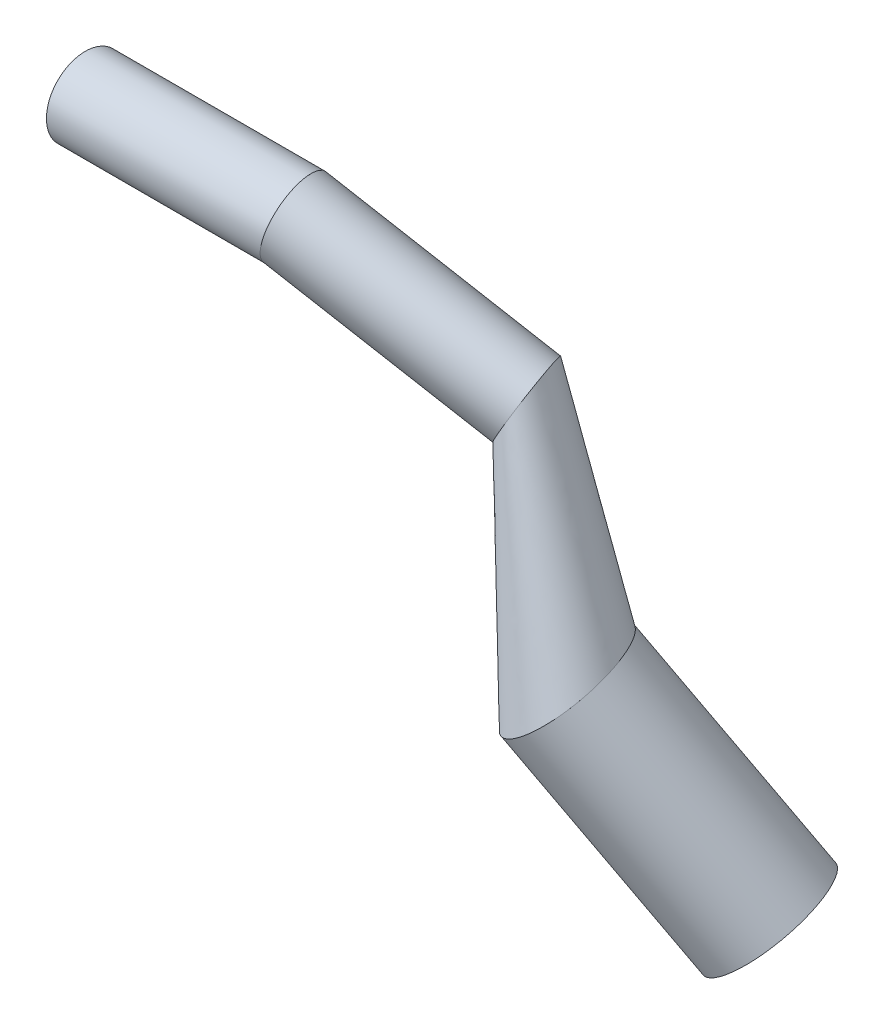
ISO-10303-21;
HEADER;
FILE_DESCRIPTION(('STEP AP214'),'2;1');
FILE_NAME('part.step','',(''),(''),'','','');
FILE_SCHEMA(('AUTOMOTIVE_DESIGN { 1 0 10303 214 1 1 1 1 }'));
ENDSEC;
DATA;
#1=APPLICATION_CONTEXT('core data for automotive mechanical design processes');
#2=APPLICATION_PROTOCOL_DEFINITION('international standard','automotive_design',2000,#1);
#3=PRODUCT_CONTEXT('',#1,'mechanical');
#4=PRODUCT('Part','Part','',(#3));
#5=PRODUCT_RELATED_PRODUCT_CATEGORY('part','',(#4));
#6=PRODUCT_DEFINITION_FORMATION('','',#4);
#7=PRODUCT_DEFINITION_CONTEXT('part definition',#1,'design');
#8=PRODUCT_DEFINITION('design','',#6,#7);
#9=PRODUCT_DEFINITION_SHAPE('','',#8);
#10=(LENGTH_UNIT() NAMED_UNIT(*) SI_UNIT(.MILLI.,.METRE.));
#11=(NAMED_UNIT(*) PLANE_ANGLE_UNIT() SI_UNIT($,.RADIAN.));
#12=(NAMED_UNIT(*) SI_UNIT($,.STERADIAN.) SOLID_ANGLE_UNIT());
#13=UNCERTAINTY_MEASURE_WITH_UNIT(LENGTH_MEASURE(1.E-05),#10,'distance_accuracy_value','');
#14=(GEOMETRIC_REPRESENTATION_CONTEXT(3) GLOBAL_UNCERTAINTY_ASSIGNED_CONTEXT((#13)) GLOBAL_UNIT_ASSIGNED_CONTEXT((#10,
#11,#12)) REPRESENTATION_CONTEXT('',''));
#15=CARTESIAN_POINT('',(0.,0.,0.));
#16=DIRECTION('',(0.,0.,1.));
#17=DIRECTION('',(1.,0.,0.));
#18=AXIS2_PLACEMENT_3D('',#15,#16,#17);
#19=CARTESIAN_POINT('',(110.458547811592,-18.1572783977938,-15.9377275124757));
#20=DIRECTION('',(-0.833138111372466,0.478048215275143,0.278120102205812));
#21=DIRECTION('',(-0.497683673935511,-0.867358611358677,0.));
#22=AXIS2_PLACEMENT_3D('',#19,#20,#21);
#23=PLANE('',#22);
#24=CARTESIAN_POINT('',(99.8578855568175,-36.6320168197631,-15.9377275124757));
#25=CARTESIAN_POINT('',(99.7508398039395,-36.5705947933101,-16.3639699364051));
#26=CARTESIAN_POINT('',(99.6507352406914,-36.4814227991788,-16.8171174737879));
#27=CARTESIAN_POINT('',(99.476785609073,-36.2277559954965,-17.7742184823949));
#28=CARTESIAN_POINT('',(99.4029375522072,-36.0631861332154,-18.2783099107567));
#29=CARTESIAN_POINT('',(99.2981651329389,-35.636345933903,-19.3258432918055));
#30=CARTESIAN_POINT('',(99.2672916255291,-35.3739056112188,-19.8694250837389));
#31=CARTESIAN_POINT('',(99.2688874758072,-34.729963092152,-20.9714885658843));
#32=CARTESIAN_POINT('',(99.3014982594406,-34.3481807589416,-21.5300281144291));
#33=CARTESIAN_POINT('',(99.451487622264,-33.451950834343,-22.6212087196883));
#34=CARTESIAN_POINT('',(99.5691073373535,-32.9371735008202,-23.1536942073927));
#35=CARTESIAN_POINT('',(99.9057838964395,-31.7786052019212,-24.1365553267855));
#36=CARTESIAN_POINT('',(100.125109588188,-31.1346158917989,-24.5864665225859));
#37=CARTESIAN_POINT('',(100.669074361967,-29.7472704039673,-25.3416088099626));
#38=CARTESIAN_POINT('',(100.993842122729,-29.0040808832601,-25.6461679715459));
#39=CARTESIAN_POINT('',(101.73309966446,-27.4753005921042,-26.0593961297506));
#40=CARTESIAN_POINT('',(102.147424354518,-26.6902997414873,-26.1675456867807));
#41=CARTESIAN_POINT('',(103.030812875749,-25.1507382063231,-26.1675456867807));
#42=CARTESIAN_POINT('',(103.499458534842,-24.3969063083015,-26.0593961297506));
#43=CARTESIAN_POINT('',(104.446270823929,-22.9872193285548,-25.6461679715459));
#44=CARTESIAN_POINT('',(104.924011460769,-22.3318044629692,-25.3416088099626));
#45=CARTESIAN_POINT('',(105.847266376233,-21.162092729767,-24.5864665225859));
#46=CARTESIAN_POINT('',(106.292571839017,-20.6477688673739,-24.1365553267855));
#47=CARTESIAN_POINT('',(107.122916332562,-19.7724634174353,-23.1536942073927));
#48=CARTESIAN_POINT('',(107.507990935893,-19.4111496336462,-22.6212087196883));
#49=CARTESIAN_POINT('',(108.206054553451,-18.8294004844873,-21.5300281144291));
#50=CARTESIAN_POINT('',(108.519206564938,-18.6085905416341,-20.9714885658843));
#51=CARTESIAN_POINT('',(109.074342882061,-18.2822652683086,-19.8694250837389));
#52=CARTESIAN_POINT('',(109.316497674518,-18.1764864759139,-19.3258432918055));
#53=CARTESIAN_POINT('',(109.737876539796,-18.0515478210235,-18.2783099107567));
#54=CARTESIAN_POINT('',(109.917221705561,-18.0322582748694,-17.7742184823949));
#55=CARTESIAN_POINT('',(110.224001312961,-18.0544301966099,-16.8171174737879));
#56=CARTESIAN_POINT('',(110.351502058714,-18.0958563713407,-16.3639699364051));
#57=CARTESIAN_POINT('',(110.56559356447,-18.2187004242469,-15.5114850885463));
#58=CARTESIAN_POINT('',(110.665698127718,-18.3078724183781,-15.0583375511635));
#59=CARTESIAN_POINT('',(110.839647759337,-18.5615392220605,-14.1012365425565));
#60=CARTESIAN_POINT('',(110.913495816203,-18.7261090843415,-13.5971451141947));
#61=CARTESIAN_POINT('',(111.018268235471,-19.1529492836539,-12.5496117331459));
#62=CARTESIAN_POINT('',(111.049141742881,-19.4153896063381,-12.0060299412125));
#63=CARTESIAN_POINT('',(111.047545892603,-20.0593321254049,-10.9039664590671));
#64=CARTESIAN_POINT('',(111.014935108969,-20.4411144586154,-10.3454269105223));
#65=CARTESIAN_POINT('',(110.864945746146,-21.337344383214,-9.2542463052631));
#66=CARTESIAN_POINT('',(110.747326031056,-21.8521217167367,-8.72176081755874));
#67=CARTESIAN_POINT('',(110.41064947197,-23.0106900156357,-7.73889969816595));
#68=CARTESIAN_POINT('',(110.191323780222,-23.654679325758,-7.28898850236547));
#69=CARTESIAN_POINT('',(109.647359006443,-25.0420248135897,-6.53384621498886));
#70=CARTESIAN_POINT('',(109.322591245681,-25.7852143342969,-6.22928705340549));
#71=CARTESIAN_POINT('',(108.58333370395,-27.3139946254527,-5.81605889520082));
#72=CARTESIAN_POINT('',(108.169009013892,-28.0989954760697,-5.70790933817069));
#73=CARTESIAN_POINT('',(107.285620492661,-29.6385570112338,-5.70790933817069));
#74=CARTESIAN_POINT('',(106.816974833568,-30.3923889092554,-5.81605889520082));
#75=CARTESIAN_POINT('',(105.870162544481,-31.8020758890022,-6.22928705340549));
#76=CARTESIAN_POINT('',(105.392421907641,-32.4574907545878,-6.53384621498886));
#77=CARTESIAN_POINT('',(104.469166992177,-33.6272024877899,-7.28898850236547));
#78=CARTESIAN_POINT('',(104.023861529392,-34.1415263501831,-7.73889969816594));
#79=CARTESIAN_POINT('',(103.193517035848,-35.0168318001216,-8.72176081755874));
#80=CARTESIAN_POINT('',(102.808442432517,-35.3781455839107,-9.25424630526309));
#81=CARTESIAN_POINT('',(102.110378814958,-35.9598947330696,-10.3454269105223));
#82=CARTESIAN_POINT('',(101.797226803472,-36.1807046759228,-10.9039664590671));
#83=CARTESIAN_POINT('',(101.242090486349,-36.5070299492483,-12.0060299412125));
#84=CARTESIAN_POINT('',(100.999935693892,-36.6128087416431,-12.5496117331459));
#85=CARTESIAN_POINT('',(100.578556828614,-36.7377473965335,-13.5971451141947));
#86=CARTESIAN_POINT('',(100.399211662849,-36.7570369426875,-14.1012365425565));
#87=CARTESIAN_POINT('',(100.092432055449,-36.734865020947,-15.0583375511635));
#88=CARTESIAN_POINT('',(99.9649313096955,-36.6934388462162,-15.5114850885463));
#89=CARTESIAN_POINT('',(99.8578855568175,-36.6320168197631,-15.9377275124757));
#90=B_SPLINE_CURVE_WITH_KNOTS('',3,(#24,#25,#26,#27,#28,#29,#30,#31,#32,#33,#34,#35,#36,#37,#38,
#39,#40,#41,#42,#43,#44,#45,#46,#47,#48,#49,#50,#51,#52,#53,#54,#55,#56,#57,#58,#59,#60,#61,#62,
#63,#64,#65,#66,#67,#68,#69,#70,#71,#72,#73,#74,#75,#76,#77,#78,#79,#80,#81,#82,#83,#84,#85,#86,
#87,#88,#89),.UNSPECIFIED.,.T.,.F.,(4,2,2,2,2,2,2,2,2,2,2,2,2,2,2,2,2,2,2,2,2,2,2,2,2,2,2,2,2,2,
2,2,4),(0.,0.0312499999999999,0.0624999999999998,0.0937499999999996,0.125,0.156249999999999,
0.187499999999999,0.218749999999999,0.249999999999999,0.281249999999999,0.312499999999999,
0.343749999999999,0.374999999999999,0.406249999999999,0.437499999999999,0.468749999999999,
0.499999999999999,0.531249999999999,0.562499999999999,0.593749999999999,0.624999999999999,
0.656249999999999,0.687499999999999,0.718749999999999,0.749999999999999,0.781249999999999,
0.812499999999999,0.843749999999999,0.874999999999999,0.90625,0.9375,0.96875,1.),.UNSPECIFIED.);
#91=CARTESIAN_POINT('',(99.8578855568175,-36.6320168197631,-15.9377275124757));
#92=VERTEX_POINT('',#91);
#93=EDGE_CURVE('E65',#92,#92,#90,.T.);
#94=ORIENTED_EDGE('',*,*,#93,.F.);
#95=EDGE_LOOP('',(#94));
#96=FACE_BOUND('',#95,.T.);
#97=ADVANCED_FACE('F56',(#96),#23,.T.);
#98=CARTESIAN_POINT('',(135.931990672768,-72.0496322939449,-9.68406513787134));
#99=DIRECTION('',(-0.580553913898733,0.757744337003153,0.297960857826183));
#100=DIRECTION('',(-0.793800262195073,-0.608178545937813,0.));
#101=AXIS2_PLACEMENT_3D('',#98,#99,#100);
#102=PLANE('',#101);
#103=CARTESIAN_POINT('',(109.180921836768,-92.5452492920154,-9.6840651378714));
#104=CARTESIAN_POINT('',(109.053694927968,-92.3791915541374,-10.354258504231));
#105=CARTESIAN_POINT('',(108.953004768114,-92.176167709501,-11.0667555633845));
#106=CARTESIAN_POINT('',(108.834924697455,-91.6748867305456,-12.5716333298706));
#107=CARTESIAN_POINT('',(108.817573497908,-91.3765146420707,-13.3642309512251));
#108=CARTESIAN_POINT('',(108.904383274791,-90.6623432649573,-15.0112981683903));
#109=CARTESIAN_POINT('',(109.008719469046,-90.2463232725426,-15.8659876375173));
#110=CARTESIAN_POINT('',(109.382234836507,-89.2787748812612,-17.5987941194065));
#111=CARTESIAN_POINT('',(109.651790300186,-88.7269224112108,-18.4770021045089));
#112=CARTESIAN_POINT('',(110.396132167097,-87.4819899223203,-20.1926971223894));
#113=CARTESIAN_POINT('',(110.871474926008,-86.7885798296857,-21.0299395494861));
#114=CARTESIAN_POINT('',(112.050610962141,-85.2774961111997,-22.5753206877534));
#115=CARTESIAN_POINT('',(112.754926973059,-84.4597091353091,-23.2827291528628));
#116=CARTESIAN_POINT('',(114.380813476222,-82.7471350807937,-24.4700613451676));
#117=CARTESIAN_POINT('',(115.302483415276,-81.8526872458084,-24.948928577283));
#118=CARTESIAN_POINT('',(117.306563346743,-80.061752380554,-25.5986592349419));
#119=CARTESIAN_POINT('',(118.38838257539,-79.1660391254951,-25.7687059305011));
#120=CARTESIAN_POINT('',(120.617638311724,-77.4580710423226,-25.7687059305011));
#121=CARTESIAN_POINT('',(121.764019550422,-76.6466247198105,-25.5986592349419));
#122=CARTESIAN_POINT('',(124.014784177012,-75.1776649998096,-24.948928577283));
#123=CARTESIAN_POINT('',(125.118266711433,-74.5205206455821,-24.4700613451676));
#124=CARTESIAN_POINT('',(127.194950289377,-73.3963311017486,-23.2827291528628));
#125=CARTESIAN_POINT('',(128.167849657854,-72.9291016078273,-22.5753206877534));
#126=CARTESIAN_POINT('',(129.933724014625,-72.183834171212,-21.0299395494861));
#127=CARTESIAN_POINT('',(130.726944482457,-71.9053210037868,-20.1926971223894));
#128=CARTESIAN_POINT('',(132.122688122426,-71.5106041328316,-18.4770021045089));
#129=CARTESIAN_POINT('',(132.725674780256,-71.3939491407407,-17.5987941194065));
#130=CARTESIAN_POINT('',(133.757088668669,-71.2850959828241,-15.8659876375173));
#131=CARTESIAN_POINT('',(134.1859267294,-71.2926188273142,-15.0112981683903));
#132=CARTESIAN_POINT('',(134.898082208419,-71.3946544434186,-13.3642309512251));
#133=CARTESIAN_POINT('',(135.181658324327,-71.4890554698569,-12.5716333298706));
#134=CARTESIAN_POINT('',(135.634938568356,-71.7335192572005,-11.0667555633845));
#135=CARTESIAN_POINT('',(135.804763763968,-71.883574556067,-10.354258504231));
#136=CARTESIAN_POINT('',(136.059217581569,-72.2156900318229,-9.01387177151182));
#137=CARTESIAN_POINT('',(136.159907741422,-72.4187138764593,-8.30137471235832));
#138=CARTESIAN_POINT('',(136.277987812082,-72.9199948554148,-6.79649694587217));
#139=CARTESIAN_POINT('',(136.295339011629,-73.2183669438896,-6.00389932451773));
#140=CARTESIAN_POINT('',(136.208529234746,-73.9325383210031,-4.35683210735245));
#141=CARTESIAN_POINT('',(136.10419304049,-74.3485583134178,-3.50214263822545));
#142=CARTESIAN_POINT('',(135.730677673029,-75.3161067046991,-1.76933615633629));
#143=CARTESIAN_POINT('',(135.46112220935,-75.8679591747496,-0.891128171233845));
#144=CARTESIAN_POINT('',(134.71678034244,-77.11289166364,0.824566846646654));
#145=CARTESIAN_POINT('',(134.241437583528,-77.8063017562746,1.66180927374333));
#146=CARTESIAN_POINT('',(133.062301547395,-79.3173854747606,3.20719041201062));
#147=CARTESIAN_POINT('',(132.357985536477,-80.1351724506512,3.91459887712));
#148=CARTESIAN_POINT('',(130.732099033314,-81.8477465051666,5.10193106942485));
#149=CARTESIAN_POINT('',(129.810429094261,-82.7421943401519,5.58079830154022));
#150=CARTESIAN_POINT('',(127.806349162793,-84.5331292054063,6.2305289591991));
#151=CARTESIAN_POINT('',(126.724529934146,-85.4288424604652,6.40057565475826));
#152=CARTESIAN_POINT('',(124.495274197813,-87.1368105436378,6.40057565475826));
#153=CARTESIAN_POINT('',(123.348892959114,-87.9482568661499,6.2305289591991));
#154=CARTESIAN_POINT('',(121.098128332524,-89.4172165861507,5.58079830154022));
#155=CARTESIAN_POINT('',(119.994645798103,-90.0743609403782,5.10193106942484));
#156=CARTESIAN_POINT('',(117.917962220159,-91.1985504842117,3.91459887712));
#157=CARTESIAN_POINT('',(116.945062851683,-91.6657799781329,3.20719041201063));
#158=CARTESIAN_POINT('',(115.179188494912,-92.4110474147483,1.66180927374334));
#159=CARTESIAN_POINT('',(114.38596802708,-92.6895605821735,0.824566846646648));
#160=CARTESIAN_POINT('',(112.99022438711,-93.0842774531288,-0.89112817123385));
#161=CARTESIAN_POINT('',(112.387237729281,-93.2009324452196,-1.76933615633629));
#162=CARTESIAN_POINT('',(111.355823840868,-93.3097856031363,-3.50214263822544));
#163=CARTESIAN_POINT('',(110.926985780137,-93.3022627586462,-4.35683210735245));
#164=CARTESIAN_POINT('',(110.214830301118,-93.2002271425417,-6.00389932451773));
#165=CARTESIAN_POINT('',(109.931254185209,-93.1058261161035,-6.79649694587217));
#166=CARTESIAN_POINT('',(109.47797394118,-92.8613623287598,-8.30137471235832));
#167=CARTESIAN_POINT('',(109.308148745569,-92.7113070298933,-9.01387177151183));
#168=CARTESIAN_POINT('',(109.180921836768,-92.5452492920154,-9.6840651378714));
#169=B_SPLINE_CURVE_WITH_KNOTS('',3,(#103,#104,#105,#106,#107,#108,#109,#110,#111,#112,#113,
#114,#115,#116,#117,#118,#119,#120,#121,#122,#123,#124,#125,#126,#127,#128,#129,#130,#131,#132,
#133,#134,#135,#136,#137,#138,#139,#140,#141,#142,#143,#144,#145,#146,#147,#148,#149,#150,#151,
#152,#153,#154,#155,#156,#157,#158,#159,#160,#161,#162,#163,#164,#165,#166,#167,#168),
.UNSPECIFIED.,.T.,.F.,(4,2,2,2,2,2,2,2,2,2,2,2,2,2,2,2,2,2,2,2,2,2,2,2,2,2,2,2,2,2,2,2,4),(0.,
0.0312499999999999,0.0624999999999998,0.0937499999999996,0.125,0.156249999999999,
0.187499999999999,0.218749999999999,0.249999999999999,0.281249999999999,0.312499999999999,
0.343749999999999,0.374999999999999,0.406249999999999,0.437499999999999,0.468749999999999,
0.499999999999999,0.531249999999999,0.562499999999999,0.593749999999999,0.624999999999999,
0.656249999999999,0.687499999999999,0.718749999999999,0.749999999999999,0.781249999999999,
0.812499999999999,0.843749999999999,0.874999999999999,0.90625,0.9375,0.96875,1.),.UNSPECIFIED.);
#170=CARTESIAN_POINT('',(109.180921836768,-92.5452492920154,-9.6840651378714));
#171=VERTEX_POINT('',#170);
#172=EDGE_CURVE('E12',#171,#171,#169,.F.);
#173=ORIENTED_EDGE('',*,*,#172,.F.);
#174=EDGE_LOOP('',(#173));
#175=FACE_BOUND('',#174,.T.);
#176=ADVANCED_FACE('F58',(#175),#102,.F.);
#177=CARTESIAN_POINT('',(99.8578855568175,-36.6320168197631,-15.9377275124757));
#178=CARTESIAN_POINT('',(109.180921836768,-92.5452492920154,-9.6840651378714));
#179=CARTESIAN_POINT('',(99.7508398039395,-36.5705947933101,-16.3639699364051));
#180=CARTESIAN_POINT('',(109.053694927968,-92.3791915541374,-10.354258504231));
#181=CARTESIAN_POINT('',(99.6507352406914,-36.4814227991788,-16.8171174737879));
#182=CARTESIAN_POINT('',(108.953004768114,-92.176167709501,-11.0667555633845));
#183=CARTESIAN_POINT('',(99.476785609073,-36.2277559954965,-17.7742184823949));
#184=CARTESIAN_POINT('',(108.834924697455,-91.6748867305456,-12.5716333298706));
#185=CARTESIAN_POINT('',(99.4029375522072,-36.0631861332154,-18.2783099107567));
#186=CARTESIAN_POINT('',(108.817573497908,-91.3765146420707,-13.3642309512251));
#187=CARTESIAN_POINT('',(99.2981651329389,-35.636345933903,-19.3258432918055));
#188=CARTESIAN_POINT('',(108.904383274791,-90.6623432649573,-15.0112981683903));
#189=CARTESIAN_POINT('',(99.2672916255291,-35.3739056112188,-19.8694250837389));
#190=CARTESIAN_POINT('',(109.008719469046,-90.2463232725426,-15.8659876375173));
#191=CARTESIAN_POINT('',(99.2688874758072,-34.729963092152,-20.9714885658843));
#192=CARTESIAN_POINT('',(109.382234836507,-89.2787748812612,-17.5987941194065));
#193=CARTESIAN_POINT('',(99.3014982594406,-34.3481807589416,-21.5300281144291));
#194=CARTESIAN_POINT('',(109.651790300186,-88.7269224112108,-18.4770021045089));
#195=CARTESIAN_POINT('',(99.451487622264,-33.451950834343,-22.6212087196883));
#196=CARTESIAN_POINT('',(110.396132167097,-87.4819899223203,-20.1926971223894));
#197=CARTESIAN_POINT('',(99.5691073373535,-32.9371735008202,-23.1536942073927));
#198=CARTESIAN_POINT('',(110.871474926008,-86.7885798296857,-21.0299395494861));
#199=CARTESIAN_POINT('',(99.9057838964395,-31.7786052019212,-24.1365553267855));
#200=CARTESIAN_POINT('',(112.050610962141,-85.2774961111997,-22.5753206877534));
#201=CARTESIAN_POINT('',(100.125109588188,-31.1346158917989,-24.5864665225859));
#202=CARTESIAN_POINT('',(112.754926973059,-84.4597091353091,-23.2827291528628));
#203=CARTESIAN_POINT('',(100.669074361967,-29.7472704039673,-25.3416088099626));
#204=CARTESIAN_POINT('',(114.380813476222,-82.7471350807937,-24.4700613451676));
#205=CARTESIAN_POINT('',(100.993842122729,-29.0040808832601,-25.6461679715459));
#206=CARTESIAN_POINT('',(115.302483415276,-81.8526872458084,-24.948928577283));
#207=CARTESIAN_POINT('',(101.73309966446,-27.4753005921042,-26.0593961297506));
#208=CARTESIAN_POINT('',(117.306563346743,-80.061752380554,-25.5986592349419));
#209=CARTESIAN_POINT('',(102.147424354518,-26.6902997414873,-26.1675456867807));
#210=CARTESIAN_POINT('',(118.38838257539,-79.1660391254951,-25.7687059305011));
#211=CARTESIAN_POINT('',(103.030812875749,-25.1507382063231,-26.1675456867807));
#212=CARTESIAN_POINT('',(120.617638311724,-77.4580710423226,-25.7687059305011));
#213=CARTESIAN_POINT('',(103.499458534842,-24.3969063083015,-26.0593961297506));
#214=CARTESIAN_POINT('',(121.764019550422,-76.6466247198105,-25.5986592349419));
#215=CARTESIAN_POINT('',(104.446270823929,-22.9872193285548,-25.6461679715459));
#216=CARTESIAN_POINT('',(124.014784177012,-75.1776649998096,-24.948928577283));
#217=CARTESIAN_POINT('',(104.924011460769,-22.3318044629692,-25.3416088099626));
#218=CARTESIAN_POINT('',(125.118266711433,-74.5205206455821,-24.4700613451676));
#219=CARTESIAN_POINT('',(105.847266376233,-21.162092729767,-24.5864665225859));
#220=CARTESIAN_POINT('',(127.194950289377,-73.3963311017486,-23.2827291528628));
#221=CARTESIAN_POINT('',(106.292571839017,-20.6477688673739,-24.1365553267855));
#222=CARTESIAN_POINT('',(128.167849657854,-72.9291016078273,-22.5753206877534));
#223=CARTESIAN_POINT('',(107.122916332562,-19.7724634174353,-23.1536942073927));
#224=CARTESIAN_POINT('',(129.933724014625,-72.183834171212,-21.0299395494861));
#225=CARTESIAN_POINT('',(107.507990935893,-19.4111496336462,-22.6212087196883));
#226=CARTESIAN_POINT('',(130.726944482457,-71.9053210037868,-20.1926971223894));
#227=CARTESIAN_POINT('',(108.206054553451,-18.8294004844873,-21.5300281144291));
#228=CARTESIAN_POINT('',(132.122688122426,-71.5106041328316,-18.4770021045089));
#229=CARTESIAN_POINT('',(108.519206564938,-18.6085905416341,-20.9714885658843));
#230=CARTESIAN_POINT('',(132.725674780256,-71.3939491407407,-17.5987941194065));
#231=CARTESIAN_POINT('',(109.074342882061,-18.2822652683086,-19.8694250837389));
#232=CARTESIAN_POINT('',(133.757088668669,-71.2850959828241,-15.8659876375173));
#233=CARTESIAN_POINT('',(109.316497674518,-18.1764864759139,-19.3258432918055));
#234=CARTESIAN_POINT('',(134.1859267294,-71.2926188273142,-15.0112981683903));
#235=CARTESIAN_POINT('',(109.737876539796,-18.0515478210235,-18.2783099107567));
#236=CARTESIAN_POINT('',(134.898082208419,-71.3946544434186,-13.3642309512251));
#237=CARTESIAN_POINT('',(109.917221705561,-18.0322582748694,-17.7742184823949));
#238=CARTESIAN_POINT('',(135.181658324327,-71.4890554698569,-12.5716333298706));
#239=CARTESIAN_POINT('',(110.224001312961,-18.0544301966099,-16.8171174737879));
#240=CARTESIAN_POINT('',(135.634938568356,-71.7335192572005,-11.0667555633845));
#241=CARTESIAN_POINT('',(110.351502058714,-18.0958563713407,-16.3639699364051));
#242=CARTESIAN_POINT('',(135.804763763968,-71.883574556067,-10.354258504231));
#243=CARTESIAN_POINT('',(110.56559356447,-18.2187004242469,-15.5114850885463));
#244=CARTESIAN_POINT('',(136.059217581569,-72.2156900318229,-9.01387177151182));
#245=CARTESIAN_POINT('',(110.665698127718,-18.3078724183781,-15.0583375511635));
#246=CARTESIAN_POINT('',(136.159907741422,-72.4187138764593,-8.30137471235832));
#247=CARTESIAN_POINT('',(110.839647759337,-18.5615392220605,-14.1012365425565));
#248=CARTESIAN_POINT('',(136.277987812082,-72.9199948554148,-6.79649694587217));
#249=CARTESIAN_POINT('',(110.913495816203,-18.7261090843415,-13.5971451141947));
#250=CARTESIAN_POINT('',(136.295339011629,-73.2183669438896,-6.00389932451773));
#251=CARTESIAN_POINT('',(111.018268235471,-19.1529492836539,-12.5496117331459));
#252=CARTESIAN_POINT('',(136.208529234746,-73.9325383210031,-4.35683210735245));
#253=CARTESIAN_POINT('',(111.049141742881,-19.4153896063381,-12.0060299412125));
#254=CARTESIAN_POINT('',(136.10419304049,-74.3485583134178,-3.50214263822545));
#255=CARTESIAN_POINT('',(111.047545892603,-20.0593321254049,-10.9039664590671));
#256=CARTESIAN_POINT('',(135.730677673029,-75.3161067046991,-1.76933615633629));
#257=CARTESIAN_POINT('',(111.014935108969,-20.4411144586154,-10.3454269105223));
#258=CARTESIAN_POINT('',(135.46112220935,-75.8679591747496,-0.891128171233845));
#259=CARTESIAN_POINT('',(110.864945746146,-21.337344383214,-9.2542463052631));
#260=CARTESIAN_POINT('',(134.71678034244,-77.11289166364,0.824566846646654));
#261=CARTESIAN_POINT('',(110.747326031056,-21.8521217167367,-8.72176081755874));
#262=CARTESIAN_POINT('',(134.241437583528,-77.8063017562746,1.66180927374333));
#263=CARTESIAN_POINT('',(110.41064947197,-23.0106900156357,-7.73889969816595));
#264=CARTESIAN_POINT('',(133.062301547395,-79.3173854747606,3.20719041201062));
#265=CARTESIAN_POINT('',(110.191323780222,-23.654679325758,-7.28898850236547));
#266=CARTESIAN_POINT('',(132.357985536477,-80.1351724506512,3.91459887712));
#267=CARTESIAN_POINT('',(109.647359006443,-25.0420248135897,-6.53384621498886));
#268=CARTESIAN_POINT('',(130.732099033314,-81.8477465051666,5.10193106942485));
#269=CARTESIAN_POINT('',(109.322591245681,-25.7852143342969,-6.22928705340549));
#270=CARTESIAN_POINT('',(129.810429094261,-82.7421943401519,5.58079830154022));
#271=CARTESIAN_POINT('',(108.58333370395,-27.3139946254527,-5.81605889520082));
#272=CARTESIAN_POINT('',(127.806349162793,-84.5331292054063,6.2305289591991));
#273=CARTESIAN_POINT('',(108.169009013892,-28.0989954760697,-5.70790933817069));
#274=CARTESIAN_POINT('',(126.724529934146,-85.4288424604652,6.40057565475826));
#275=CARTESIAN_POINT('',(107.285620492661,-29.6385570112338,-5.70790933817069));
#276=CARTESIAN_POINT('',(124.495274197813,-87.1368105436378,6.40057565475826));
#277=CARTESIAN_POINT('',(106.816974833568,-30.3923889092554,-5.81605889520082));
#278=CARTESIAN_POINT('',(123.348892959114,-87.9482568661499,6.2305289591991));
#279=CARTESIAN_POINT('',(105.870162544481,-31.8020758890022,-6.22928705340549));
#280=CARTESIAN_POINT('',(121.098128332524,-89.4172165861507,5.58079830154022));
#281=CARTESIAN_POINT('',(105.392421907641,-32.4574907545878,-6.53384621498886));
#282=CARTESIAN_POINT('',(119.994645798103,-90.0743609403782,5.10193106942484));
#283=CARTESIAN_POINT('',(104.469166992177,-33.6272024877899,-7.28898850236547));
#284=CARTESIAN_POINT('',(117.917962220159,-91.1985504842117,3.91459887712));
#285=CARTESIAN_POINT('',(104.023861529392,-34.1415263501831,-7.73889969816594));
#286=CARTESIAN_POINT('',(116.945062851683,-91.6657799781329,3.20719041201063));
#287=CARTESIAN_POINT('',(103.193517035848,-35.0168318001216,-8.72176081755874));
#288=CARTESIAN_POINT('',(115.179188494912,-92.4110474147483,1.66180927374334));
#289=CARTESIAN_POINT('',(102.808442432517,-35.3781455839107,-9.25424630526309));
#290=CARTESIAN_POINT('',(114.38596802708,-92.6895605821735,0.824566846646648));
#291=CARTESIAN_POINT('',(102.110378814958,-35.9598947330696,-10.3454269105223));
#292=CARTESIAN_POINT('',(112.99022438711,-93.0842774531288,-0.89112817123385));
#293=CARTESIAN_POINT('',(101.797226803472,-36.1807046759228,-10.9039664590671));
#294=CARTESIAN_POINT('',(112.387237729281,-93.2009324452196,-1.76933615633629));
#295=CARTESIAN_POINT('',(101.242090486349,-36.5070299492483,-12.0060299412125));
#296=CARTESIAN_POINT('',(111.355823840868,-93.3097856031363,-3.50214263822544));
#297=CARTESIAN_POINT('',(100.999935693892,-36.6128087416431,-12.5496117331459));
#298=CARTESIAN_POINT('',(110.926985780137,-93.3022627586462,-4.35683210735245));
#299=CARTESIAN_POINT('',(100.578556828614,-36.7377473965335,-13.5971451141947));
#300=CARTESIAN_POINT('',(110.214830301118,-93.2002271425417,-6.00389932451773));
#301=CARTESIAN_POINT('',(100.399211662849,-36.7570369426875,-14.1012365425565));
#302=CARTESIAN_POINT('',(109.931254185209,-93.1058261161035,-6.79649694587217));
#303=CARTESIAN_POINT('',(100.092432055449,-36.734865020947,-15.0583375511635));
#304=CARTESIAN_POINT('',(109.47797394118,-92.8613623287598,-8.30137471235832));
#305=CARTESIAN_POINT('',(99.9649313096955,-36.6934388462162,-15.5114850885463));
#306=CARTESIAN_POINT('',(109.308148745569,-92.7113070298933,-9.01387177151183));
#307=CARTESIAN_POINT('',(99.8578855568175,-36.6320168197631,-15.9377275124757));
#308=CARTESIAN_POINT('',(109.180921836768,-92.5452492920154,-9.6840651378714));
#309=B_SPLINE_SURFACE_WITH_KNOTS('',3,1,((#177,#178),(#179,#180),(#181,#182),(#183,#184),(#185,
#186),(#187,#188),(#189,#190),(#191,#192),(#193,#194),(#195,#196),(#197,#198),(#199,#200),(#201,
#202),(#203,#204),(#205,#206),(#207,#208),(#209,#210),(#211,#212),(#213,#214),(#215,#216),(#217,
#218),(#219,#220),(#221,#222),(#223,#224),(#225,#226),(#227,#228),(#229,#230),(#231,#232),(#233,
#234),(#235,#236),(#237,#238),(#239,#240),(#241,#242),(#243,#244),(#245,#246),(#247,#248),(#249,
#250),(#251,#252),(#253,#254),(#255,#256),(#257,#258),(#259,#260),(#261,#262),(#263,#264),(#265,
#266),(#267,#268),(#269,#270),(#271,#272),(#273,#274),(#275,#276),(#277,#278),(#279,#280),(#281,
#282),(#283,#284),(#285,#286),(#287,#288),(#289,#290),(#291,#292),(#293,#294),(#295,#296),(#297,
#298),(#299,#300),(#301,#302),(#303,#304),(#305,#306),(#307,#308)),.UNSPECIFIED.,.T.,.F.,.F.,(4,
2,2,2,2,2,2,2,2,2,2,2,2,2,2,2,2,2,2,2,2,2,2,2,2,2,2,2,2,2,2,2,4),(2,2),(0.,0.0312499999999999,
0.0624999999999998,0.0937499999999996,0.125,0.156249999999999,0.187499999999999,
0.218749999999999,0.249999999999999,0.281249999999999,0.312499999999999,0.343749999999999,
0.374999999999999,0.406249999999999,0.437499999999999,0.468749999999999,0.499999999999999,
0.531249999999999,0.562499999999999,0.593749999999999,0.624999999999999,0.656249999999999,
0.687499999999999,0.718749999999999,0.749999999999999,0.781249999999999,0.812499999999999,
0.843749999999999,0.874999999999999,0.90625,0.9375,0.96875,1.),(0.,1.),.UNSPECIFIED.);
#310=ORIENTED_EDGE('',*,*,#93,.T.);
#311=EDGE_LOOP('',(#310));
#312=FACE_BOUND('',#311,.T.);
#313=ORIENTED_EDGE('',*,*,#172,.T.);
#314=EDGE_LOOP('',(#313));
#315=FACE_BOUND('',#314,.T.);
#316=ADVANCED_FACE('F76',(#312,#315),#309,.T.);
#317=CLOSED_SHELL('',(#97,#176,#316));
#318=MANIFOLD_SOLID_BREP('B2',#317);
#319=CARTESIAN_POINT('',(159.210495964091,-130.138632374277,-28.4962182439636));
#320=DIRECTION('',(-0.580553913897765,0.757744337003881,0.297960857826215));
#321=DIRECTION('',(-0.793800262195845,-0.608178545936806,0.));
#322=AXIS2_PLACEMENT_3D('',#319,#320,#321);
#323=CYLINDRICAL_SURFACE('',#322,12.85);
#324=CARTESIAN_POINT('',(159.210495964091,-130.138632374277,-28.4962182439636));
#325=DIRECTION('',(0.580553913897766,-0.757744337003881,-0.297960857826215));
#326=DIRECTION('',(0.793800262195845,0.608178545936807,0.));
#327=AXIS2_PLACEMENT_3D('',#324,#325,#326);
#328=CIRCLE('',#327,12.85);
#329=CARTESIAN_POINT('',(169.410829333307,-122.323538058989,-28.4962182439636));
#330=VERTEX_POINT('',#329);
#331=EDGE_CURVE('E132',#330,#330,#328,.T.);
#332=ORIENTED_EDGE('',*,*,#331,.T.);
#333=EDGE_LOOP('',(#332));
#334=FACE_BOUND('',#333,.T.);
#335=CARTESIAN_POINT('',(122.556456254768,-82.2974407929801,-9.68406513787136));
#336=DIRECTION('',(0.580553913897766,-0.757744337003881,-0.297960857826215));
#337=DIRECTION('',(0.793800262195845,0.608178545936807,0.));
#338=AXIS2_PLACEMENT_3D('',#335,#336,#337);
#339=CIRCLE('',#338,12.85);
#340=CARTESIAN_POINT('',(132.756789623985,-74.4823464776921,-9.68406513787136));
#341=VERTEX_POINT('',#340);
#342=EDGE_CURVE('E138',#341,#341,#339,.T.);
#343=ORIENTED_EDGE('',*,*,#342,.F.);
#344=EDGE_LOOP('',(#343));
#345=FACE_BOUND('',#344,.T.);
#346=ADVANCED_FACE('F125',(#334,#345),#323,.F.);
#347=CARTESIAN_POINT('',(159.210495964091,-130.138632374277,-28.4962182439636));
#348=DIRECTION('',(-0.580553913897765,0.757744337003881,0.297960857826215));
#349=DIRECTION('',(-0.793800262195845,-0.608178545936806,0.));
#350=AXIS2_PLACEMENT_3D('',#347,#348,#349);
#351=CYLINDRICAL_SURFACE('',#350,16.85);
#352=CARTESIAN_POINT('',(159.210495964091,-130.138632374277,-28.4962182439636));
#353=DIRECTION('',(0.580553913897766,-0.757744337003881,-0.297960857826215));
#354=DIRECTION('',(0.793800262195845,0.608178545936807,0.));
#355=AXIS2_PLACEMENT_3D('',#352,#353,#354);
#356=CIRCLE('',#355,16.85);
#357=CARTESIAN_POINT('',(172.586030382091,-119.890823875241,-28.4962182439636));
#358=VERTEX_POINT('',#357);
#359=EDGE_CURVE('E55',#358,#358,#356,.T.);
#360=ORIENTED_EDGE('',*,*,#359,.F.);
#361=EDGE_LOOP('',(#360));
#362=FACE_BOUND('',#361,.T.);
#363=CARTESIAN_POINT('',(122.556456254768,-82.2974407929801,-9.68406513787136));
#364=DIRECTION('',(0.580553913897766,-0.757744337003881,-0.297960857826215));
#365=DIRECTION('',(0.793800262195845,0.608178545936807,0.));
#366=AXIS2_PLACEMENT_3D('',#363,#364,#365);
#367=CIRCLE('',#366,16.85);
#368=CARTESIAN_POINT('',(135.931990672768,-72.0496322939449,-9.68406513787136));
#369=VERTEX_POINT('',#368);
#370=EDGE_CURVE('E128',#369,#369,#367,.T.);
#371=ORIENTED_EDGE('',*,*,#370,.T.);
#372=EDGE_LOOP('',(#371));
#373=FACE_BOUND('',#372,.T.);
#374=ADVANCED_FACE('F145',(#362,#373),#351,.T.);
#375=CARTESIAN_POINT('',(159.210495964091,-130.138632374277,-28.4962182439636));
#376=DIRECTION('',(0.580553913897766,-0.757744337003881,-0.297960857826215));
#377=DIRECTION('',(0.793800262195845,0.608178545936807,0.));
#378=AXIS2_PLACEMENT_3D('',#375,#376,#377);
#379=PLANE('',#378);
#380=ORIENTED_EDGE('',*,*,#331,.F.);
#381=EDGE_LOOP('',(#380));
#382=FACE_BOUND('',#381,.T.);
#383=ORIENTED_EDGE('',*,*,#359,.T.);
#384=EDGE_LOOP('',(#383));
#385=FACE_BOUND('',#384,.T.);
#386=ADVANCED_FACE('F149',(#382,#385),#379,.T.);
#387=CARTESIAN_POINT('',(122.556456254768,-82.2974407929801,-9.68406513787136));
#388=DIRECTION('',(0.580553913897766,-0.757744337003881,-0.297960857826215));
#389=DIRECTION('',(0.793800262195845,0.608178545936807,0.));
#390=AXIS2_PLACEMENT_3D('',#387,#388,#389);
#391=PLANE('',#390);
#392=ORIENTED_EDGE('',*,*,#342,.T.);
#393=EDGE_LOOP('',(#392));
#394=FACE_BOUND('',#393,.T.);
#395=ORIENTED_EDGE('',*,*,#370,.F.);
#396=EDGE_LOOP('',(#395));
#397=FACE_BOUND('',#396,.T.);
#398=ADVANCED_FACE('F147',(#394,#397),#391,.F.);
#399=CLOSED_SHELL('',(#346,#374,#386,#398));
#400=MANIFOLD_SOLID_BREP('B7',#399);
#401=CARTESIAN_POINT('',(57.4150722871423,0.,0.));
#402=DIRECTION('',(-1.,0.,0.));
#403=DIRECTION('',(0.,0.,1.));
#404=AXIS2_PLACEMENT_3D('',#401,#402,#403);
#405=CYLINDRICAL_SURFACE('',#404,8.35);
#406=CARTESIAN_POINT('',(0.,0.,0.));
#407=DIRECTION('',(1.,0.,0.));
#408=DIRECTION('',(0.,0.,-1.));
#409=AXIS2_PLACEMENT_3D('',#406,#407,#408);
#410=CIRCLE('',#409,8.35);
#411=CARTESIAN_POINT('',(0.,0.,-8.35));
#412=VERTEX_POINT('',#411);
#413=EDGE_CURVE('E210',#412,#412,#410,.T.);
#414=ORIENTED_EDGE('',*,*,#413,.F.);
#415=EDGE_LOOP('',(#414));
#416=FACE_BOUND('',#415,.T.);
#417=CARTESIAN_POINT('',(57.4150722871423,0.,0.));
#418=DIRECTION('',(0.957376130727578,-0.249665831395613,-0.145251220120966));
#419=DIRECTION('',(-0.288844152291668,-0.827519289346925,-0.481436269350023));
#420=AXIS2_PLACEMENT_3D('',#417,#418,#419);
#421=ELLIPSE('',#420,8.72175494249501,8.35);
#422=CARTESIAN_POINT('',(54.8958443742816,-7.2174204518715,-4.19896916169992));
#423=VERTEX_POINT('',#422);
#424=EDGE_CURVE('E206',#423,#423,#421,.T.);
#425=ORIENTED_EDGE('',*,*,#424,.T.);
#426=EDGE_LOOP('',(#425));
#427=FACE_BOUND('',#426,.T.);
#428=ADVANCED_FACE('F202',(#416,#427),#405,.F.);
#429=CARTESIAN_POINT('',(57.4150722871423,0.,0.));
#430=DIRECTION('',(-1.,0.,0.));
#431=DIRECTION('',(0.,0.,1.));
#432=AXIS2_PLACEMENT_3D('',#429,#430,#431);
#433=CYLINDRICAL_SURFACE('',#432,10.65);
#434=CARTESIAN_POINT('',(0.,0.,0.));
#435=DIRECTION('',(1.,0.,0.));
#436=DIRECTION('',(0.,0.,-1.));
#437=AXIS2_PLACEMENT_3D('',#434,#435,#436);
#438=CIRCLE('',#437,10.65);
#439=CARTESIAN_POINT('',(0.,0.,-10.65));
#440=VERTEX_POINT('',#439);
#441=EDGE_CURVE('E214',#440,#440,#438,.T.);
#442=ORIENTED_EDGE('',*,*,#441,.T.);
#443=EDGE_LOOP('',(#442));
#444=FACE_BOUND('',#443,.T.);
#445=CARTESIAN_POINT('',(57.4150722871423,0.,0.));
#446=DIRECTION('',(0.957376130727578,-0.249665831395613,-0.145251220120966));
#447=DIRECTION('',(-0.288844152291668,-0.827519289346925,-0.481436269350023));
#448=AXIS2_PLACEMENT_3D('',#445,#446,#447);
#449=ELLIPSE('',#448,11.1241545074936,10.65);
#450=CARTESIAN_POINT('',(54.2019253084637,-9.20545243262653,-5.35557144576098));
#451=VERTEX_POINT('',#450);
#452=EDGE_CURVE('E124',#451,#451,#449,.T.);
#453=ORIENTED_EDGE('',*,*,#452,.F.);
#454=EDGE_LOOP('',(#453));
#455=FACE_BOUND('',#454,.T.);
#456=ADVANCED_FACE('F229',(#444,#455),#433,.T.);
#457=CARTESIAN_POINT('',(0.,0.,0.));
#458=DIRECTION('',(1.,0.,0.));
#459=DIRECTION('',(0.,0.,-1.));
#460=AXIS2_PLACEMENT_3D('',#457,#458,#459);
#461=PLANE('',#460);
#462=ORIENTED_EDGE('',*,*,#413,.T.);
#463=EDGE_LOOP('',(#462));
#464=FACE_BOUND('',#463,.T.);
#465=ORIENTED_EDGE('',*,*,#441,.F.);
#466=EDGE_LOOP('',(#465));
#467=FACE_BOUND('',#466,.T.);
#468=ADVANCED_FACE('F225',(#464,#467),#461,.F.);
#469=CARTESIAN_POINT('',(57.4150722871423,0.,0.));
#470=DIRECTION('',(0.957376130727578,-0.249665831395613,-0.145251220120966));
#471=DIRECTION('',(0.252341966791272,0.967638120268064,0.));
#472=AXIS2_PLACEMENT_3D('',#469,#470,#471);
#473=PLANE('',#472);
#474=ORIENTED_EDGE('',*,*,#424,.F.);
#475=EDGE_LOOP('',(#474));
#476=FACE_BOUND('',#475,.T.);
#477=ORIENTED_EDGE('',*,*,#452,.T.);
#478=EDGE_LOOP('',(#477));
#479=FACE_BOUND('',#478,.T.);
#480=ADVANCED_FACE('F204',(#476,#479),#473,.T.);
#481=CLOSED_SHELL('',(#428,#456,#468,#480));
#482=MANIFOLD_SOLID_BREP('B50',#481);
#483=CARTESIAN_POINT('',(105.158216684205,-27.3946476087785,-15.9377275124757));
#484=DIRECTION('',(-0.833138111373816,0.478048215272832,0.278120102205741));
#485=DIRECTION('',(-0.497683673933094,-0.867358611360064,0.));
#486=AXIS2_PLACEMENT_3D('',#483,#484,#485);
#487=CYLINDRICAL_SURFACE('',#486,8.35);
#488=CARTESIAN_POINT('',(57.4150722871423,0.,0.));
#489=DIRECTION('',(0.957376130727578,-0.249665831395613,-0.145251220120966));
#490=DIRECTION('',(0.288844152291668,0.827519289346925,0.481436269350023));
#491=AXIS2_PLACEMENT_3D('',#488,#489,#490);
#492=ELLIPSE('',#491,8.72175494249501,8.35);
#493=CARTESIAN_POINT('',(59.9343002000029,7.21742045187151,4.19896916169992));
#494=VERTEX_POINT('',#493);
#495=EDGE_CURVE('E278',#494,#494,#492,.T.);
#496=ORIENTED_EDGE('',*,*,#495,.F.);
#497=EDGE_LOOP('',(#496));
#498=FACE_BOUND('',#497,.T.);
#499=CARTESIAN_POINT('',(105.158216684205,-27.3946476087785,-15.9377275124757));
#500=DIRECTION('',(0.833138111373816,-0.478048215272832,-0.278120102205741));
#501=DIRECTION('',(-0.278120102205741,0.0725285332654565,-0.957804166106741));
#502=AXIS2_PLACEMENT_3D('',#499,#500,#501);
#503=CIRCLE('',#502,8.35);
#504=CARTESIAN_POINT('',(102.835913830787,-26.7890343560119,-23.935392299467));
#505=VERTEX_POINT('',#504);
#506=EDGE_CURVE('E287',#505,#505,#503,.T.);
#507=ORIENTED_EDGE('',*,*,#506,.T.);
#508=EDGE_LOOP('',(#507));
#509=FACE_BOUND('',#508,.T.);
#510=ADVANCED_FACE('F272',(#498,#509),#487,.F.);
#511=CARTESIAN_POINT('',(105.158216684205,-27.3946476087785,-15.9377275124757));
#512=DIRECTION('',(0.833138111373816,-0.478048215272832,-0.278120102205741));
#513=DIRECTION('',(-0.278120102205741,0.0725285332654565,-0.957804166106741));
#514=AXIS2_PLACEMENT_3D('',#511,#512,#513);
#515=PLANE('',#514);
#516=ORIENTED_EDGE('',*,*,#506,.F.);
#517=EDGE_LOOP('',(#516));
#518=FACE_BOUND('',#517,.T.);
#519=CARTESIAN_POINT('',(105.158216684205,-27.3946476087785,-15.9377275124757));
#520=DIRECTION('',(0.833138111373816,-0.478048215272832,-0.278120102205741));
#521=DIRECTION('',(-0.278120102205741,0.0725285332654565,-0.957804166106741));
#522=AXIS2_PLACEMENT_3D('',#519,#520,#521);
#523=CIRCLE('',#522,10.65);
#524=CARTESIAN_POINT('',(102.196237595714,-26.6222187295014,-26.1383418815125));
#525=VERTEX_POINT('',#524);
#526=EDGE_CURVE('E282',#525,#525,#523,.T.);
#527=ORIENTED_EDGE('',*,*,#526,.T.);
#528=EDGE_LOOP('',(#527));
#529=FACE_BOUND('',#528,.T.);
#530=ADVANCED_FACE('F293',(#518,#529),#515,.T.);
#531=CARTESIAN_POINT('',(105.158216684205,-27.3946476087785,-15.9377275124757));
#532=DIRECTION('',(-0.833138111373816,0.478048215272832,0.278120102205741));
#533=DIRECTION('',(-0.497683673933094,-0.867358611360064,0.));
#534=AXIS2_PLACEMENT_3D('',#531,#532,#533);
#535=CYLINDRICAL_SURFACE('',#534,10.65);
#536=CARTESIAN_POINT('',(57.4150722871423,0.,0.));
#537=DIRECTION('',(0.957376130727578,-0.249665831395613,-0.145251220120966));
#538=DIRECTION('',(0.288844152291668,0.827519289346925,0.481436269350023));
#539=AXIS2_PLACEMENT_3D('',#536,#537,#538);
#540=ELLIPSE('',#539,11.1241545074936,10.65);
#541=CARTESIAN_POINT('',(60.6282192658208,9.20545243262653,5.35557144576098));
#542=VERTEX_POINT('',#541);
#543=EDGE_CURVE('E201',#542,#542,#540,.T.);
#544=ORIENTED_EDGE('',*,*,#543,.T.);
#545=EDGE_LOOP('',(#544));
#546=FACE_BOUND('',#545,.T.);
#547=ORIENTED_EDGE('',*,*,#526,.F.);
#548=EDGE_LOOP('',(#547));
#549=FACE_BOUND('',#548,.T.);
#550=ADVANCED_FACE('F296',(#546,#549),#535,.T.);
#551=CARTESIAN_POINT('',(57.4150722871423,0.,0.));
#552=DIRECTION('',(0.957376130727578,-0.249665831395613,-0.145251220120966));
#553=DIRECTION('',(0.252341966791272,0.967638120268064,0.));
#554=AXIS2_PLACEMENT_3D('',#551,#552,#553);
#555=PLANE('',#554);
#556=ORIENTED_EDGE('',*,*,#495,.T.);
#557=EDGE_LOOP('',(#556));
#558=FACE_BOUND('',#557,.T.);
#559=ORIENTED_EDGE('',*,*,#543,.F.);
#560=EDGE_LOOP('',(#559));
#561=FACE_BOUND('',#560,.T.);
#562=ADVANCED_FACE('F301',(#558,#561),#555,.F.);
#563=CLOSED_SHELL('',(#510,#530,#550,#562));
#564=MANIFOLD_SOLID_BREP('B119',#563);
#565=ADVANCED_BREP_SHAPE_REPRESENTATION('',(#18,#318,#400,#482,#564),#14);
#566=SHAPE_DEFINITION_REPRESENTATION(#9,#565);
ENDSEC;
END-ISO-10303-21;
